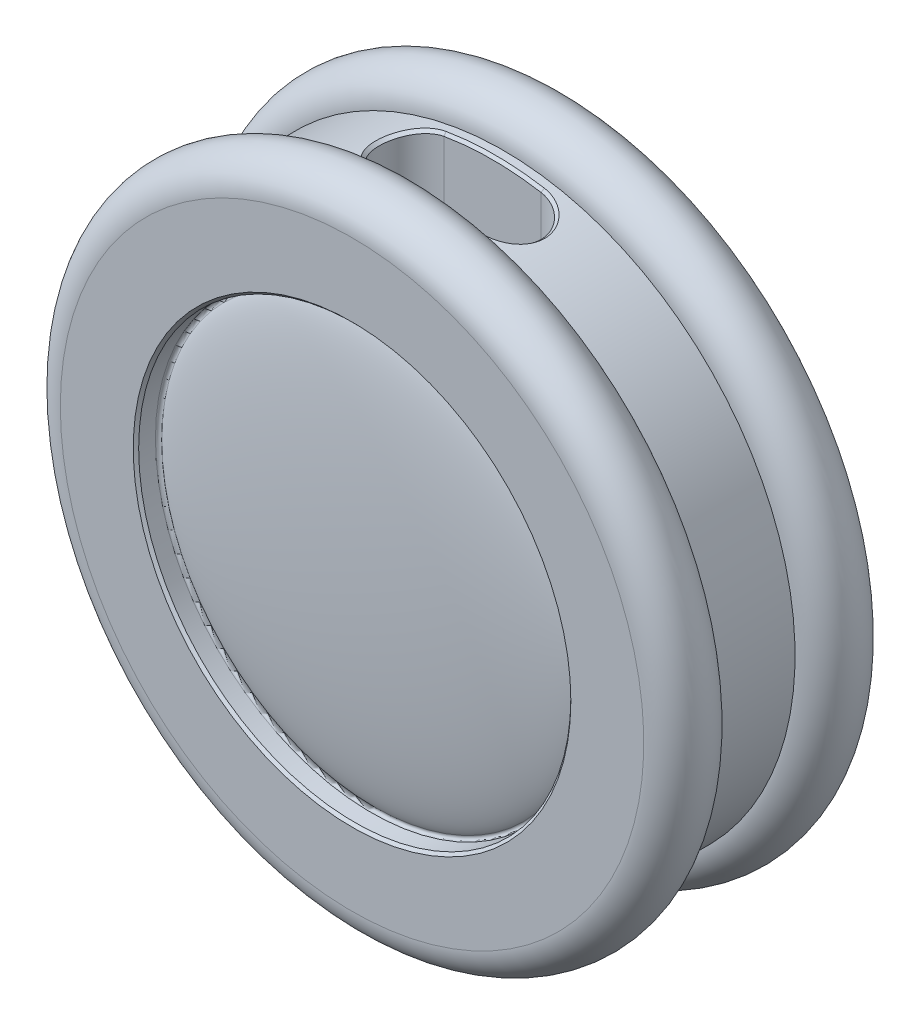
ISO-10303-21;
HEADER;
FILE_DESCRIPTION(('STEP AP214'),'2;1');
FILE_NAME('part.step','',(''),(''),'','','');
FILE_SCHEMA(('AUTOMOTIVE_DESIGN { 1 0 10303 214 1 1 1 1 }'));
ENDSEC;
DATA;
#1=APPLICATION_CONTEXT('core data for automotive mechanical design processes');
#2=APPLICATION_PROTOCOL_DEFINITION('international standard','automotive_design',2000,#1);
#3=PRODUCT_CONTEXT('',#1,'mechanical');
#4=PRODUCT('Part','Part','',(#3));
#5=PRODUCT_RELATED_PRODUCT_CATEGORY('part','',(#4));
#6=PRODUCT_DEFINITION_FORMATION('','',#4);
#7=PRODUCT_DEFINITION_CONTEXT('part definition',#1,'design');
#8=PRODUCT_DEFINITION('design','',#6,#7);
#9=PRODUCT_DEFINITION_SHAPE('','',#8);
#10=(LENGTH_UNIT() NAMED_UNIT(*) SI_UNIT(.MILLI.,.METRE.));
#11=(NAMED_UNIT(*) PLANE_ANGLE_UNIT() SI_UNIT($,.RADIAN.));
#12=(NAMED_UNIT(*) SI_UNIT($,.STERADIAN.) SOLID_ANGLE_UNIT());
#13=UNCERTAINTY_MEASURE_WITH_UNIT(LENGTH_MEASURE(1.E-05),#10,'distance_accuracy_value','');
#14=(GEOMETRIC_REPRESENTATION_CONTEXT(3) GLOBAL_UNCERTAINTY_ASSIGNED_CONTEXT((#13)) GLOBAL_UNIT_ASSIGNED_CONTEXT((#10,
#11,#12)) REPRESENTATION_CONTEXT('',''));
#15=CARTESIAN_POINT('',(0.,0.,0.));
#16=DIRECTION('',(0.,0.,1.));
#17=DIRECTION('',(1.,0.,0.));
#18=AXIS2_PLACEMENT_3D('',#15,#16,#17);
#19=CARTESIAN_POINT('',(0.,0.,-15.));
#20=DIRECTION('',(0.,1.,0.));
#21=DIRECTION('',(-1.,0.,0.));
#22=AXIS2_PLACEMENT_3D('',#19,#20,#21);
#23=ELLIPSE('',#22,40.,5.);
#24=TRIMMED_CURVE('',#23,(PARAMETER_VALUE(4.71238898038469)),
(PARAMETER_VALUE(7.85398163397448)),.T.,.PARAMETER.);
#25=CARTESIAN_POINT('',(0.,0.,-20.));
#26=DIRECTION('',(0.,0.,-1.));
#27=AXIS1_PLACEMENT('',#25,#26);
#28=SURFACE_OF_REVOLUTION('',#24,#27);
#29=CARTESIAN_POINT('',(0.,0.,-15.9740299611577));
#30=DIRECTION('',(0.,0.,-1.));
#31=DIRECTION('',(-1.,0.,0.));
#32=AXIS2_PLACEMENT_3D('',#29,#30,#31);
#33=CIRCLE('',#32,39.2336717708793);
#34=CARTESIAN_POINT('',(-39.2336717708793,0.,-15.9740299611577));
#35=VERTEX_POINT('',#34);
#36=EDGE_CURVE('E247',#35,#35,#33,.T.);
#37=ORIENTED_EDGE('',*,*,#36,.T.);
#38=EDGE_LOOP('',(#37));
#39=FACE_BOUND('',#38,.T.);
#40=CARTESIAN_POINT('',(0.,0.,-20.));
#41=VERTEX_POINT('',#40);
#42=VERTEX_LOOP('',#41);
#43=FACE_BOUND('',#42,.T.);
#44=ADVANCED_FACE('F31',(#39,#43),#28,.F.);
#45=CARTESIAN_POINT('',(0.,0.,-20.));
#46=DIRECTION('',(0.,0.,-1.));
#47=DIRECTION('',(-1.,0.,0.));
#48=AXIS2_PLACEMENT_3D('',#45,#46,#47);
#49=CYLINDRICAL_SURFACE('',#48,40.);
#50=CARTESIAN_POINT('',(0.,0.,-16.3971957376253));
#51=DIRECTION('',(0.,0.,-1.));
#52=DIRECTION('',(-1.,0.,0.));
#53=AXIS2_PLACEMENT_3D('',#50,#51,#52);
#54=CIRCLE('',#53,40.);
#55=CARTESIAN_POINT('',(-40.,0.,-16.3971957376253));
#56=VERTEX_POINT('',#55);
#57=EDGE_CURVE('E468',#56,#56,#54,.F.);
#58=ORIENTED_EDGE('',*,*,#57,.T.);
#59=EDGE_LOOP('',(#58));
#60=FACE_BOUND('',#59,.T.);
#61=CARTESIAN_POINT('',(0.,0.,-19.5));
#62=DIRECTION('',(0.,0.,-1.));
#63=DIRECTION('',(-1.,0.,0.));
#64=AXIS2_PLACEMENT_3D('',#61,#62,#63);
#65=CIRCLE('',#64,40.);
#66=CARTESIAN_POINT('',(-40.,0.,-19.5));
#67=VERTEX_POINT('',#66);
#68=EDGE_CURVE('E233',#67,#67,#65,.T.);
#69=ORIENTED_EDGE('',*,*,#68,.T.);
#70=EDGE_LOOP('',(#69));
#71=FACE_BOUND('',#70,.T.);
#72=ADVANCED_FACE('F120',(#60,#71),#49,.F.);
#73=CARTESIAN_POINT('',(-54.,0.,-20.));
#74=DIRECTION('',(0.,0.,-1.));
#75=DIRECTION('',(-1.,0.,0.));
#76=AXIS2_PLACEMENT_3D('',#73,#74,#75);
#77=PLANE('',#76);
#78=CARTESIAN_POINT('',(0.,0.,-20.));
#79=DIRECTION('',(0.,0.,-1.));
#80=DIRECTION('',(-1.,0.,0.));
#81=AXIS2_PLACEMENT_3D('',#78,#79,#80);
#82=CIRCLE('',#81,40.5);
#83=CARTESIAN_POINT('',(-40.5,0.,-20.));
#84=VERTEX_POINT('',#83);
#85=EDGE_CURVE('E238',#84,#84,#82,.F.);
#86=ORIENTED_EDGE('',*,*,#85,.T.);
#87=EDGE_LOOP('',(#86));
#88=FACE_BOUND('',#87,.T.);
#89=CARTESIAN_POINT('',(0.,0.,-20.));
#90=DIRECTION('',(0.,0.,-1.));
#91=DIRECTION('',(-1.,0.,0.));
#92=AXIS2_PLACEMENT_3D('',#89,#90,#91);
#93=CIRCLE('',#92,54.);
#94=CARTESIAN_POINT('',(-54.,0.,-20.));
#95=VERTEX_POINT('',#94);
#96=EDGE_CURVE('E153',#95,#95,#93,.T.);
#97=ORIENTED_EDGE('',*,*,#96,.T.);
#98=EDGE_LOOP('',(#97));
#99=FACE_BOUND('',#98,.T.);
#100=ADVANCED_FACE('F126',(#88,#99),#77,.T.);
#101=CARTESIAN_POINT('',(0.,0.,-14.));
#102=DIRECTION('',(0.,0.,-1.));
#103=DIRECTION('',(-1.,0.,0.));
#104=AXIS2_PLACEMENT_3D('',#101,#102,#103);
#105=TOROIDAL_SURFACE('',#104,54.,6.);
#106=CARTESIAN_POINT('',(0.,0.,-8.));
#107=DIRECTION('',(0.,0.,-1.));
#108=DIRECTION('',(-1.,0.,0.));
#109=AXIS2_PLACEMENT_3D('',#106,#107,#108);
#110=CIRCLE('',#109,54.);
#111=CARTESIAN_POINT('',(-54.,0.,-8.));
#112=VERTEX_POINT('',#111);
#113=EDGE_CURVE('E150',#112,#112,#110,.T.);
#114=ORIENTED_EDGE('',*,*,#113,.T.);
#115=EDGE_LOOP('',(#114));
#116=FACE_BOUND('',#115,.T.);
#117=ORIENTED_EDGE('',*,*,#96,.F.);
#118=EDGE_LOOP('',(#117));
#119=FACE_BOUND('',#118,.T.);
#120=ADVANCED_FACE('F502',(#116,#119),#105,.T.);
#121=CARTESIAN_POINT('',(0.,0.,-20.));
#122=DIRECTION('',(0.,0.,-1.));
#123=DIRECTION('',(-1.,0.,0.));
#124=AXIS2_PLACEMENT_3D('',#121,#122,#123);
#125=CYLINDRICAL_SURFACE('',#124,54.);
#126=CARTESIAN_POINT('',(9.08411214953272,53.2304321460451,6.50000000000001));
#127=CARTESIAN_POINT('',(10.8154472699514,52.9375034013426,6.50339188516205));
#128=CARTESIAN_POINT('',(12.4870608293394,52.5532988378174,5.80759504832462));
#129=CARTESIAN_POINT('',(14.9235216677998,51.9103789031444,3.4202630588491));
#130=CARTESIAN_POINT('',(15.6458849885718,51.6836683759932,1.72041286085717));
#131=CARTESIAN_POINT('',(15.6438259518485,51.6843827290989,-1.73537074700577));
#132=CARTESIAN_POINT('',(14.9175348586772,51.9119249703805,-3.42758029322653));
#133=CARTESIAN_POINT('',(12.4853224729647,52.5537794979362,-5.8078662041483));
#134=CARTESIAN_POINT('',(10.8023158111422,52.9398504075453,-6.503933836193));
#135=CARTESIAN_POINT('',(9.08411214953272,53.2304321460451,-6.5));
#136=B_SPLINE_CURVE_WITH_KNOTS('',3,(#126,#127,#128,#129,#130,#131,#132,#133,#134,#135),
.UNSPECIFIED.,.F.,.F.,(4,2,2,2,4),(0.,0.00514342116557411,0.0102868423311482,0.0154302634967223,
0.0205736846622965),.UNSPECIFIED.);
#137=CARTESIAN_POINT('',(9.08411214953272,53.2304321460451,-6.5));
#138=VERTEX_POINT('',#137);
#139=CARTESIAN_POINT('',(9.08411214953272,53.2304321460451,6.50000000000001));
#140=VERTEX_POINT('',#139);
#141=EDGE_CURVE('E558',#138,#140,#136,.F.);
#142=ORIENTED_EDGE('',*,*,#141,.T.);
#143=CARTESIAN_POINT('',(0.,0.,6.5));
#144=DIRECTION('',(0.,0.,1.));
#145=DIRECTION('',(1.,0.,0.));
#146=AXIS2_PLACEMENT_3D('',#143,#144,#145);
#147=CIRCLE('',#146,54.);
#148=CARTESIAN_POINT('',(-9.08411214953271,53.2304321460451,6.50000000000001));
#149=VERTEX_POINT('',#148);
#150=EDGE_CURVE('E560',#140,#149,#147,.T.);
#151=ORIENTED_EDGE('',*,*,#150,.T.);
#152=CARTESIAN_POINT('',(-9.0841121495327,53.2304321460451,-6.5));
#153=CARTESIAN_POINT('',(-10.8154472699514,52.9375034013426,-6.50339188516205));
#154=CARTESIAN_POINT('',(-12.4870608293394,52.5532988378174,-5.80759504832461));
#155=CARTESIAN_POINT('',(-14.9235216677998,51.9103789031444,-3.4202630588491));
#156=CARTESIAN_POINT('',(-15.6458849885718,51.6836683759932,-1.72041286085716));
#157=CARTESIAN_POINT('',(-15.6438259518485,51.6843827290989,1.73537074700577));
#158=CARTESIAN_POINT('',(-14.9175348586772,51.9119249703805,3.42758029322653));
#159=CARTESIAN_POINT('',(-12.4853224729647,52.5537794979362,5.80786620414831));
#160=CARTESIAN_POINT('',(-10.8023158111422,52.9398504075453,6.503933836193));
#161=CARTESIAN_POINT('',(-9.08411214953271,53.2304321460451,6.50000000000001));
#162=B_SPLINE_CURVE_WITH_KNOTS('',3,(#152,#153,#154,#155,#156,#157,#158,#159,#160,#161),
.UNSPECIFIED.,.F.,.F.,(4,2,2,2,4),(0.,0.00514342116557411,0.0102868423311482,0.0154302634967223,
0.0205736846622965),.UNSPECIFIED.);
#163=CARTESIAN_POINT('',(-9.0841121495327,53.2304321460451,-6.5));
#164=VERTEX_POINT('',#163);
#165=EDGE_CURVE('E348',#149,#164,#162,.F.);
#166=ORIENTED_EDGE('',*,*,#165,.T.);
#167=CARTESIAN_POINT('',(0.,0.,-6.5));
#168=DIRECTION('',(0.,0.,-1.));
#169=DIRECTION('',(-1.,0.,0.));
#170=AXIS2_PLACEMENT_3D('',#167,#168,#169);
#171=CIRCLE('',#170,54.);
#172=EDGE_CURVE('E544',#164,#138,#171,.T.);
#173=ORIENTED_EDGE('',*,*,#172,.T.);
#174=EDGE_LOOP('',(#142,#151,#166,#173));
#175=FACE_BOUND('',#174,.T.);
#176=CARTESIAN_POINT('',(-9.08411214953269,-53.2304321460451,6.50000000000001));
#177=CARTESIAN_POINT('',(-10.8154472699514,-52.9375034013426,6.50339188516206));
#178=CARTESIAN_POINT('',(-12.4870608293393,-52.5532988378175,5.80759504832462));
#179=CARTESIAN_POINT('',(-14.9235216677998,-51.9103789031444,3.42026305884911));
#180=CARTESIAN_POINT('',(-15.6458849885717,-51.6836683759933,1.72041286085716));
#181=CARTESIAN_POINT('',(-15.6438259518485,-51.6843827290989,-1.73537074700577));
#182=CARTESIAN_POINT('',(-14.9175348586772,-51.9119249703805,-3.42758029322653));
#183=CARTESIAN_POINT('',(-12.4853224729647,-52.5537794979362,-5.8078662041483));
#184=CARTESIAN_POINT('',(-10.8023158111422,-52.9398504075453,-6.50393383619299));
#185=CARTESIAN_POINT('',(-9.08411214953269,-53.2304321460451,-6.5));
#186=B_SPLINE_CURVE_WITH_KNOTS('',3,(#176,#177,#178,#179,#180,#181,#182,#183,#184,#185),
.UNSPECIFIED.,.F.,.F.,(4,2,2,2,4),(0.,0.00514342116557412,0.0102868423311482,0.0154302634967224,
0.0205736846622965),.UNSPECIFIED.);
#187=CARTESIAN_POINT('',(-9.08411214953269,-53.2304321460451,-6.5));
#188=VERTEX_POINT('',#187);
#189=CARTESIAN_POINT('',(-9.08411214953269,-53.2304321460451,6.50000000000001));
#190=VERTEX_POINT('',#189);
#191=EDGE_CURVE('E545',#188,#190,#186,.F.);
#192=ORIENTED_EDGE('',*,*,#191,.T.);
#193=CARTESIAN_POINT('',(0.,0.,6.5));
#194=DIRECTION('',(0.,0.,1.));
#195=DIRECTION('',(1.,0.,0.));
#196=AXIS2_PLACEMENT_3D('',#193,#194,#195);
#197=CIRCLE('',#196,54.);
#198=CARTESIAN_POINT('',(9.08411214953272,-53.2304321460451,6.5));
#199=VERTEX_POINT('',#198);
#200=EDGE_CURVE('E537',#190,#199,#197,.T.);
#201=ORIENTED_EDGE('',*,*,#200,.T.);
#202=CARTESIAN_POINT('',(9.08411214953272,-53.2304321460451,-6.50000000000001));
#203=CARTESIAN_POINT('',(10.8154472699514,-52.9375034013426,-6.50339188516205));
#204=CARTESIAN_POINT('',(12.4870608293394,-52.5532988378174,-5.80759504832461));
#205=CARTESIAN_POINT('',(14.9235216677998,-51.9103789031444,-3.4202630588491));
#206=CARTESIAN_POINT('',(15.6458849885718,-51.6836683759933,-1.72041286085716));
#207=CARTESIAN_POINT('',(15.6438259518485,-51.6843827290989,1.73537074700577));
#208=CARTESIAN_POINT('',(14.9175348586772,-51.9119249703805,3.42758029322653));
#209=CARTESIAN_POINT('',(12.4853224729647,-52.5537794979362,5.8078662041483));
#210=CARTESIAN_POINT('',(10.8023158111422,-52.9398504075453,6.50393383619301));
#211=CARTESIAN_POINT('',(9.08411214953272,-53.2304321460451,6.5));
#212=B_SPLINE_CURVE_WITH_KNOTS('',3,(#202,#203,#204,#205,#206,#207,#208,#209,#210,#211),
.UNSPECIFIED.,.F.,.F.,(4,2,2,2,4),(0.,0.00514342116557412,0.0102868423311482,0.0154302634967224,
0.0205736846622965),.UNSPECIFIED.);
#213=CARTESIAN_POINT('',(9.08411214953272,-53.2304321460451,-6.5));
#214=VERTEX_POINT('',#213);
#215=EDGE_CURVE('E457',#199,#214,#212,.F.);
#216=ORIENTED_EDGE('',*,*,#215,.T.);
#217=CARTESIAN_POINT('',(0.,0.,-6.5));
#218=DIRECTION('',(0.,0.,-1.));
#219=DIRECTION('',(-1.,0.,0.));
#220=AXIS2_PLACEMENT_3D('',#217,#218,#219);
#221=CIRCLE('',#220,54.);
#222=EDGE_CURVE('E571',#214,#188,#221,.T.);
#223=ORIENTED_EDGE('',*,*,#222,.T.);
#224=EDGE_LOOP('',(#192,#201,#216,#223));
#225=FACE_BOUND('',#224,.T.);
#226=CARTESIAN_POINT('',(0.,0.,8.));
#227=DIRECTION('',(0.,0.,-1.));
#228=DIRECTION('',(-1.,0.,0.));
#229=AXIS2_PLACEMENT_3D('',#226,#227,#228);
#230=CIRCLE('',#229,54.);
#231=CARTESIAN_POINT('',(-54.,0.,8.));
#232=VERTEX_POINT('',#231);
#233=EDGE_CURVE('E146',#232,#232,#230,.T.);
#234=ORIENTED_EDGE('',*,*,#233,.T.);
#235=EDGE_LOOP('',(#234));
#236=FACE_BOUND('',#235,.T.);
#237=ORIENTED_EDGE('',*,*,#113,.F.);
#238=EDGE_LOOP('',(#237));
#239=FACE_BOUND('',#238,.T.);
#240=ADVANCED_FACE('F506',(#175,#225,#236,#239),#125,.T.);
#241=CARTESIAN_POINT('',(0.,0.,14.));
#242=DIRECTION('',(0.,0.,-1.));
#243=DIRECTION('',(-1.,0.,0.));
#244=AXIS2_PLACEMENT_3D('',#241,#242,#243);
#245=TOROIDAL_SURFACE('',#244,54.,6.);
#246=CARTESIAN_POINT('',(0.,0.,20.));
#247=DIRECTION('',(0.,0.,-1.));
#248=DIRECTION('',(-1.,0.,0.));
#249=AXIS2_PLACEMENT_3D('',#246,#247,#248);
#250=CIRCLE('',#249,54.);
#251=CARTESIAN_POINT('',(-54.,0.,20.));
#252=VERTEX_POINT('',#251);
#253=EDGE_CURVE('E143',#252,#252,#250,.T.);
#254=ORIENTED_EDGE('',*,*,#253,.T.);
#255=EDGE_LOOP('',(#254));
#256=FACE_BOUND('',#255,.T.);
#257=ORIENTED_EDGE('',*,*,#233,.F.);
#258=EDGE_LOOP('',(#257));
#259=FACE_BOUND('',#258,.T.);
#260=ADVANCED_FACE('F512',(#256,#259),#245,.T.);
#261=CARTESIAN_POINT('',(-54.,0.,20.));
#262=DIRECTION('',(0.,0.,1.));
#263=DIRECTION('',(1.,0.,0.));
#264=AXIS2_PLACEMENT_3D('',#261,#262,#263);
#265=PLANE('',#264);
#266=CARTESIAN_POINT('',(0.,0.,20.));
#267=DIRECTION('',(0.,0.,1.));
#268=DIRECTION('',(1.,0.,0.));
#269=AXIS2_PLACEMENT_3D('',#266,#267,#268);
#270=CIRCLE('',#269,40.5);
#271=CARTESIAN_POINT('',(40.5,0.,20.));
#272=VERTEX_POINT('',#271);
#273=EDGE_CURVE('E241',#272,#272,#270,.F.);
#274=ORIENTED_EDGE('',*,*,#273,.T.);
#275=EDGE_LOOP('',(#274));
#276=FACE_BOUND('',#275,.T.);
#277=ORIENTED_EDGE('',*,*,#253,.F.);
#278=EDGE_LOOP('',(#277));
#279=FACE_BOUND('',#278,.T.);
#280=ADVANCED_FACE('F115',(#276,#279),#265,.T.);
#281=CARTESIAN_POINT('',(0.,0.,-20.));
#282=DIRECTION('',(0.,0.,-1.));
#283=DIRECTION('',(-1.,0.,0.));
#284=AXIS2_PLACEMENT_3D('',#281,#282,#283);
#285=CYLINDRICAL_SURFACE('',#284,40.);
#286=CARTESIAN_POINT('',(0.,0.,16.3971957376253));
#287=DIRECTION('',(0.,0.,-1.));
#288=DIRECTION('',(-1.,0.,0.));
#289=AXIS2_PLACEMENT_3D('',#286,#287,#288);
#290=CIRCLE('',#289,40.);
#291=CARTESIAN_POINT('',(-40.,0.,16.3971957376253));
#292=VERTEX_POINT('',#291);
#293=EDGE_CURVE('E39',#292,#292,#290,.T.);
#294=ORIENTED_EDGE('',*,*,#293,.T.);
#295=EDGE_LOOP('',(#294));
#296=FACE_BOUND('',#295,.T.);
#297=CARTESIAN_POINT('',(0.,0.,19.5));
#298=DIRECTION('',(0.,0.,1.));
#299=DIRECTION('',(1.,0.,0.));
#300=AXIS2_PLACEMENT_3D('',#297,#298,#299);
#301=CIRCLE('',#300,40.);
#302=CARTESIAN_POINT('',(40.,0.,19.5));
#303=VERTEX_POINT('',#302);
#304=EDGE_CURVE('E244',#303,#303,#301,.T.);
#305=ORIENTED_EDGE('',*,*,#304,.T.);
#306=EDGE_LOOP('',(#305));
#307=FACE_BOUND('',#306,.T.);
#308=ADVANCED_FACE('F106',(#296,#307),#285,.F.);
#309=CARTESIAN_POINT('',(0.,0.,15.));
#310=DIRECTION('',(0.,1.,0.));
#311=DIRECTION('',(1.,0.,0.));
#312=AXIS2_PLACEMENT_3D('',#309,#310,#311);
#313=ELLIPSE('',#312,40.,5.);
#314=TRIMMED_CURVE('',#313,(PARAMETER_VALUE(1.5707963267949)),
(PARAMETER_VALUE(4.71238898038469)),.T.,.PARAMETER.);
#315=CARTESIAN_POINT('',(0.,0.,-20.));
#316=DIRECTION('',(0.,0.,-1.));
#317=AXIS1_PLACEMENT('',#315,#316);
#318=SURFACE_OF_REVOLUTION('',#314,#317);
#319=CARTESIAN_POINT('',(0.,0.,15.9740299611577));
#320=DIRECTION('',(0.,0.,-1.));
#321=DIRECTION('',(-1.,0.,0.));
#322=AXIS2_PLACEMENT_3D('',#319,#320,#321);
#323=CIRCLE('',#322,39.2336717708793);
#324=CARTESIAN_POINT('',(-39.2336717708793,0.,15.9740299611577));
#325=VERTEX_POINT('',#324);
#326=EDGE_CURVE('E11',#325,#325,#323,.F.);
#327=ORIENTED_EDGE('',*,*,#326,.T.);
#328=EDGE_LOOP('',(#327));
#329=FACE_BOUND('',#328,.T.);
#330=CARTESIAN_POINT('',(0.,0.,20.));
#331=VERTEX_POINT('',#330);
#332=VERTEX_LOOP('',#331);
#333=FACE_BOUND('',#332,.T.);
#334=ADVANCED_FACE('F103',(#329,#333),#318,.F.);
#335=CARTESIAN_POINT('',(-9.,-55.,0.));
#336=DIRECTION('',(0.,1.,0.));
#337=DIRECTION('',(0.,0.,1.));
#338=AXIS2_PLACEMENT_3D('',#335,#336,#337);
#339=CYLINDRICAL_SURFACE('',#338,6.);
#340=DIRECTION('',(0.,1.,0.));
#341=VECTOR('',#340,1.);
#342=CARTESIAN_POINT('',(-9.,-55.,-5.99999999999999));
#343=LINE('',#342,#341);
#344=CARTESIAN_POINT('',(-9.,-52.7375577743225,-5.99999999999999));
#345=VERTEX_POINT('',#344);
#346=CARTESIAN_POINT('',(-9.,52.7375577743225,-5.99999999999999));
#347=VERTEX_POINT('',#346);
#348=EDGE_CURVE('E147',#345,#347,#343,.T.);
#349=ORIENTED_EDGE('',*,*,#348,.T.);
#350=CARTESIAN_POINT('',(-9.00000000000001,52.7375577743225,6.00000000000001));
#351=CARTESIAN_POINT('',(-10.5713486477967,52.4496666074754,6.00363123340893));
#352=CARTESIAN_POINT('',(-12.1105086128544,52.067170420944,5.36110723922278));
#353=CARTESIAN_POINT('',(-14.3348395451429,51.4312590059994,3.16392029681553));
#354=CARTESIAN_POINT('',(-14.9990545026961,51.2058236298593,1.60188115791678));
#355=CARTESIAN_POINT('',(-15.0009375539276,51.2051158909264,-1.58807387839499));
#356=CARTESIAN_POINT('',(-14.3403146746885,51.4297272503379,-3.1571659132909));
#357=CARTESIAN_POINT('',(-12.1120983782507,52.0666942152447,-5.36085695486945));
#358=CARTESIAN_POINT('',(-10.5833577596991,52.4473413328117,-6.00313097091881));
#359=CARTESIAN_POINT('',(-9.,52.7375577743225,-6.));
#360=B_SPLINE_CURVE_WITH_KNOTS('',3,(#350,#351,#352,#353,#354,#355,#356,#357,#358,#359),
.UNSPECIFIED.,.F.,.F.,(4,2,2,2,4),(0.,0.00514342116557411,0.0102868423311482,0.0154302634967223,
0.0205736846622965),.UNSPECIFIED.);
#361=CARTESIAN_POINT('',(-9.,52.7375577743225,6.00000000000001));
#362=VERTEX_POINT('',#361);
#363=EDGE_CURVE('E229',#347,#362,#360,.F.);
#364=ORIENTED_EDGE('',*,*,#363,.T.);
#365=DIRECTION('',(0.,1.,0.));
#366=VECTOR('',#365,1.);
#367=CARTESIAN_POINT('',(-9.,-55.,6.00000000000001));
#368=LINE('',#367,#366);
#369=CARTESIAN_POINT('',(-9.,-52.7375577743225,6.00000000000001));
#370=VERTEX_POINT('',#369);
#371=EDGE_CURVE('E157',#370,#362,#368,.T.);
#372=ORIENTED_EDGE('',*,*,#371,.F.);
#373=CARTESIAN_POINT('',(-9.,-52.7375577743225,-5.99999999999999));
#374=CARTESIAN_POINT('',(-10.5713486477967,-52.4496666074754,-6.00363123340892));
#375=CARTESIAN_POINT('',(-12.1105086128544,-52.067170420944,-5.36110723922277));
#376=CARTESIAN_POINT('',(-14.3348395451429,-51.4312590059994,-3.16392029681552));
#377=CARTESIAN_POINT('',(-14.9990545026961,-51.2058236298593,-1.60188115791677));
#378=CARTESIAN_POINT('',(-15.0009375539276,-51.2051158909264,1.58807387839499));
#379=CARTESIAN_POINT('',(-14.3403146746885,-51.4297272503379,3.1571659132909));
#380=CARTESIAN_POINT('',(-12.1120983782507,-52.0666942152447,5.36085695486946));
#381=CARTESIAN_POINT('',(-10.5833577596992,-52.4473413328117,6.00313097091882));
#382=CARTESIAN_POINT('',(-9.,-52.7375577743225,6.00000000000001));
#383=B_SPLINE_CURVE_WITH_KNOTS('',3,(#373,#374,#375,#376,#377,#378,#379,#380,#381,#382),
.UNSPECIFIED.,.F.,.F.,(4,2,2,2,4),(0.,0.00514342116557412,0.0102868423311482,0.0154302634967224,
0.0205736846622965),.UNSPECIFIED.);
#384=EDGE_CURVE('E53',#370,#345,#383,.F.);
#385=ORIENTED_EDGE('',*,*,#384,.T.);
#386=EDGE_LOOP('',(#349,#364,#372,#385));
#387=FACE_BOUND('',#386,.T.);
#388=ADVANCED_FACE('F105',(#387),#339,.F.);
#389=CARTESIAN_POINT('',(9.,-55.,-6.));
#390=DIRECTION('',(0.,0.,-1.));
#391=DIRECTION('',(-1.,0.,0.));
#392=AXIS2_PLACEMENT_3D('',#389,#390,#391);
#393=PLANE('',#392);
#394=DIRECTION('',(0.,1.,0.));
#395=VECTOR('',#394,1.);
#396=CARTESIAN_POINT('',(9.,-55.,-6.));
#397=LINE('',#396,#395);
#398=CARTESIAN_POINT('',(9.,-52.7375577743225,-6.));
#399=VERTEX_POINT('',#398);
#400=CARTESIAN_POINT('',(9.,52.7375577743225,-6.));
#401=VERTEX_POINT('',#400);
#402=EDGE_CURVE('E164',#399,#401,#397,.T.);
#403=ORIENTED_EDGE('',*,*,#402,.T.);
#404=CARTESIAN_POINT('',(0.,0.,-6.));
#405=DIRECTION('',(0.,0.,-1.));
#406=DIRECTION('',(-1.,0.,0.));
#407=AXIS2_PLACEMENT_3D('',#404,#405,#406);
#408=CIRCLE('',#407,53.5);
#409=EDGE_CURVE('E46',#401,#347,#408,.F.);
#410=ORIENTED_EDGE('',*,*,#409,.T.);
#411=ORIENTED_EDGE('',*,*,#348,.F.);
#412=CARTESIAN_POINT('',(0.,0.,-6.));
#413=DIRECTION('',(0.,0.,-1.));
#414=DIRECTION('',(-1.,0.,0.));
#415=AXIS2_PLACEMENT_3D('',#412,#413,#414);
#416=CIRCLE('',#415,53.5);
#417=EDGE_CURVE('E222',#345,#399,#416,.F.);
#418=ORIENTED_EDGE('',*,*,#417,.T.);
#419=EDGE_LOOP('',(#403,#410,#411,#418));
#420=FACE_BOUND('',#419,.T.);
#421=ADVANCED_FACE('F113',(#420),#393,.F.);
#422=CARTESIAN_POINT('',(9.,-55.,0.));
#423=DIRECTION('',(0.,1.,0.));
#424=DIRECTION('',(0.,0.,1.));
#425=AXIS2_PLACEMENT_3D('',#422,#423,#424);
#426=CYLINDRICAL_SURFACE('',#425,6.);
#427=DIRECTION('',(0.,1.,0.));
#428=VECTOR('',#427,1.);
#429=CARTESIAN_POINT('',(9.,-55.,6.));
#430=LINE('',#429,#428);
#431=CARTESIAN_POINT('',(9.,-52.7375577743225,6.));
#432=VERTEX_POINT('',#431);
#433=CARTESIAN_POINT('',(9.,52.7375577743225,6.));
#434=VERTEX_POINT('',#433);
#435=EDGE_CURVE('E160',#432,#434,#430,.T.);
#436=ORIENTED_EDGE('',*,*,#435,.T.);
#437=CARTESIAN_POINT('',(9.,52.7375577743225,-6.));
#438=CARTESIAN_POINT('',(10.5713486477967,52.4496666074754,-6.00363123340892));
#439=CARTESIAN_POINT('',(12.1105086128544,52.067170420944,-5.36110723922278));
#440=CARTESIAN_POINT('',(14.3348395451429,51.4312590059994,-3.16392029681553));
#441=CARTESIAN_POINT('',(14.9990545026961,51.2058236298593,-1.60188115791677));
#442=CARTESIAN_POINT('',(15.0009375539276,51.2051158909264,1.58807387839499));
#443=CARTESIAN_POINT('',(14.3403146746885,51.4297272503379,3.1571659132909));
#444=CARTESIAN_POINT('',(12.1120983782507,52.0666942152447,5.36085695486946));
#445=CARTESIAN_POINT('',(10.5833577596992,52.4473413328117,6.00313097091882));
#446=CARTESIAN_POINT('',(9.00000000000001,52.7375577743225,6.00000000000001));
#447=B_SPLINE_CURVE_WITH_KNOTS('',3,(#437,#438,#439,#440,#441,#442,#443,#444,#445,#446),
.UNSPECIFIED.,.F.,.F.,(4,2,2,2,4),(0.,0.00514342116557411,0.0102868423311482,0.0154302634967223,
0.0205736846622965),.UNSPECIFIED.);
#448=EDGE_CURVE('E562',#434,#401,#447,.F.);
#449=ORIENTED_EDGE('',*,*,#448,.T.);
#450=ORIENTED_EDGE('',*,*,#402,.F.);
#451=CARTESIAN_POINT('',(9.,-52.7375577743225,6.));
#452=CARTESIAN_POINT('',(10.5713486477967,-52.4496666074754,6.00363123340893));
#453=CARTESIAN_POINT('',(12.1105086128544,-52.067170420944,5.36110723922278));
#454=CARTESIAN_POINT('',(14.3348395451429,-51.4312590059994,3.16392029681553));
#455=CARTESIAN_POINT('',(14.9990545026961,-51.2058236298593,1.60188115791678));
#456=CARTESIAN_POINT('',(15.0009375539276,-51.2051158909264,-1.58807387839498));
#457=CARTESIAN_POINT('',(14.3403146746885,-51.4297272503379,-3.1571659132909));
#458=CARTESIAN_POINT('',(12.1120983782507,-52.0666942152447,-5.36085695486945));
#459=CARTESIAN_POINT('',(10.5833577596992,-52.4473413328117,-6.00313097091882));
#460=CARTESIAN_POINT('',(9.,-52.7375577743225,-6.));
#461=B_SPLINE_CURVE_WITH_KNOTS('',3,(#451,#452,#453,#454,#455,#456,#457,#458,#459,#460),
.UNSPECIFIED.,.F.,.F.,(4,2,2,2,4),(0.,0.00514342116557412,0.0102868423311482,0.0154302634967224,
0.0205736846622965),.UNSPECIFIED.);
#462=EDGE_CURVE('E180',#399,#432,#461,.F.);
#463=ORIENTED_EDGE('',*,*,#462,.T.);
#464=EDGE_LOOP('',(#436,#449,#450,#463));
#465=FACE_BOUND('',#464,.T.);
#466=ADVANCED_FACE('F187',(#465),#426,.F.);
#467=CARTESIAN_POINT('',(9.,-55.,6.));
#468=DIRECTION('',(0.,0.,1.));
#469=DIRECTION('',(1.,0.,0.));
#470=AXIS2_PLACEMENT_3D('',#467,#468,#469);
#471=PLANE('',#470);
#472=ORIENTED_EDGE('',*,*,#371,.T.);
#473=CARTESIAN_POINT('',(0.,0.,6.));
#474=DIRECTION('',(0.,0.,1.));
#475=DIRECTION('',(1.,0.,0.));
#476=AXIS2_PLACEMENT_3D('',#473,#474,#475);
#477=CIRCLE('',#476,53.5);
#478=EDGE_CURVE('E568',#362,#434,#477,.F.);
#479=ORIENTED_EDGE('',*,*,#478,.T.);
#480=ORIENTED_EDGE('',*,*,#435,.F.);
#481=CARTESIAN_POINT('',(0.,0.,6.));
#482=DIRECTION('',(0.,0.,1.));
#483=DIRECTION('',(1.,0.,0.));
#484=AXIS2_PLACEMENT_3D('',#481,#482,#483);
#485=CIRCLE('',#484,53.5);
#486=EDGE_CURVE('E156',#432,#370,#485,.F.);
#487=ORIENTED_EDGE('',*,*,#486,.T.);
#488=EDGE_LOOP('',(#472,#479,#480,#487));
#489=FACE_BOUND('',#488,.T.);
#490=ADVANCED_FACE('F197',(#489),#471,.F.);
#491=CARTESIAN_POINT('',(0.,0.,-6.));
#492=DIRECTION('',(0.,0.,-1.));
#493=DIRECTION('',(-1.,0.,0.));
#494=AXIS2_PLACEMENT_3D('',#491,#492,#493);
#495=CONICAL_SURFACE('',#494,53.5,0.785398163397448);
#496=CARTESIAN_POINT('',(9.08411214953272,53.2304321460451,-6.5));
#497=CARTESIAN_POINT('',(9.,52.7375577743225,-6.));
#498=B_SPLINE_CURVE_WITH_KNOTS('',1,(#496,#497),.UNSPECIFIED.,.F.,.F.,(2,2),(0.,1.),.UNSPECIFIED.);
#499=EDGE_CURVE('E314',#138,#401,#498,.T.);
#500=ORIENTED_EDGE('',*,*,#499,.F.);
#501=ORIENTED_EDGE('',*,*,#172,.F.);
#502=CARTESIAN_POINT('',(-9.,52.7375577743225,-6.));
#503=CARTESIAN_POINT('',(-9.00350467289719,52.7580942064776,-6.02083333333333));
#504=CARTESIAN_POINT('',(-9.00700934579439,52.7786306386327,-6.04166666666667));
#505=CARTESIAN_POINT('',(-9.01401869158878,52.8197035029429,-6.08333333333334));
#506=CARTESIAN_POINT('',(-9.01752336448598,52.840239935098,-6.10416666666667));
#507=CARTESIAN_POINT('',(-9.02453271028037,52.8813127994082,-6.14583333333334));
#508=CARTESIAN_POINT('',(-9.02803738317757,52.9018492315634,-6.16666666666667));
#509=CARTESIAN_POINT('',(-9.03504672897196,52.9429220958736,-6.20833333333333));
#510=CARTESIAN_POINT('',(-9.03855140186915,52.9634585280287,-6.22916666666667));
#511=CARTESIAN_POINT('',(-9.04556074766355,53.0045313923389,-6.27083333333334));
#512=CARTESIAN_POINT('',(-9.04906542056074,53.025067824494,-6.29166666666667));
#513=CARTESIAN_POINT('',(-9.05607476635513,53.0661406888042,-6.33333333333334));
#514=CARTESIAN_POINT('',(-9.05957943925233,53.0866771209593,-6.35416666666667));
#515=CARTESIAN_POINT('',(-9.06658878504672,53.1277499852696,-6.39583333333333));
#516=CARTESIAN_POINT('',(-9.07009345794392,53.1482864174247,-6.41666666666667));
#517=CARTESIAN_POINT('',(-9.07710280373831,53.1893592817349,-6.45833333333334));
#518=CARTESIAN_POINT('',(-9.08060747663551,53.20989571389,-6.47916666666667));
#519=CARTESIAN_POINT('',(-9.0841121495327,53.2304321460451,-6.5));
#520=B_SPLINE_CURVE_WITH_KNOTS('',3,(#502,#503,#504,#505,#506,#507,#508,#509,#510,#511,#512,
#513,#514,#515,#516,#517,#518,#519),.UNSPECIFIED.,.F.,.F.,(4,2,2,2,2,2,2,2,4),(0.,
0.0883883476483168,0.176776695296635,0.265165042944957,0.353553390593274,0.441941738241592,
0.530330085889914,0.618718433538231,0.707106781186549),.UNSPECIFIED.);
#521=EDGE_CURVE('E161',#347,#164,#520,.T.);
#522=ORIENTED_EDGE('',*,*,#521,.F.);
#523=ORIENTED_EDGE('',*,*,#409,.F.);
#524=EDGE_LOOP('',(#500,#501,#522,#523));
#525=FACE_BOUND('',#524,.T.);
#526=ADVANCED_FACE('F318',(#525),#495,.T.);
#527=CARTESIAN_POINT('',(-9.,52.7375577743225,-6.));
#528=CARTESIAN_POINT('',(-10.5833577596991,52.4473413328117,-6.00313097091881));
#529=CARTESIAN_POINT('',(-12.1120983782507,52.0666942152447,-5.36085695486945));
#530=CARTESIAN_POINT('',(-14.3403146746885,51.4297272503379,-3.1571659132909));
#531=CARTESIAN_POINT('',(-15.0009375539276,51.2051158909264,-1.58807387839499));
#532=CARTESIAN_POINT('',(-14.9990545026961,51.2058236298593,1.60188115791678));
#533=CARTESIAN_POINT('',(-14.3348395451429,51.4312590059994,3.16392029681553));
#534=CARTESIAN_POINT('',(-12.1105086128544,52.067170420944,5.36110723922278));
#535=CARTESIAN_POINT('',(-10.5713486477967,52.4496666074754,6.00363123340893));
#536=CARTESIAN_POINT('',(-9.00000000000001,52.7375577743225,6.00000000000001));
#537=CARTESIAN_POINT('',(-9.0841121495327,53.2304321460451,-6.5));
#538=CARTESIAN_POINT('',(-10.8154472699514,52.9375034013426,-6.50339188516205));
#539=CARTESIAN_POINT('',(-12.4870608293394,52.5532988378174,-5.80759504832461));
#540=CARTESIAN_POINT('',(-14.9235216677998,51.9103789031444,-3.4202630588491));
#541=CARTESIAN_POINT('',(-15.6458849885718,51.6836683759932,-1.72041286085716));
#542=CARTESIAN_POINT('',(-15.6438259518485,51.6843827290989,1.73537074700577));
#543=CARTESIAN_POINT('',(-14.9175348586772,51.9119249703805,3.42758029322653));
#544=CARTESIAN_POINT('',(-12.4853224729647,52.5537794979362,5.80786620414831));
#545=CARTESIAN_POINT('',(-10.8023158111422,52.9398504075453,6.503933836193));
#546=CARTESIAN_POINT('',(-9.08411214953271,53.2304321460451,6.50000000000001));
#547=B_SPLINE_SURFACE_WITH_KNOTS('',1,3,((#527,#528,#529,#530,#531,#532,#533,#534,#535,#536),
(#537,#538,#539,#540,#541,#542,#543,#544,#545,#546)),.UNSPECIFIED.,.F.,.F.,.F.,(2,2),(4,2,2,2,
4),(0.,1.),(0.,0.00514342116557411,0.0102868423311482,0.0154302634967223,0.0205736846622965),.UNSPECIFIED.);
#548=CARTESIAN_POINT('',(-9.08411214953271,53.2304321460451,6.50000000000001));
#549=CARTESIAN_POINT('',(-9.00000000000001,52.7375577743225,6.00000000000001));
#550=B_SPLINE_CURVE_WITH_KNOTS('',1,(#548,#549),.UNSPECIFIED.,.F.,.F.,(2,2),(0.,1.),.UNSPECIFIED.);
#551=EDGE_CURVE('E561',#362,#149,#550,.F.);
#552=ORIENTED_EDGE('',*,*,#521,.T.);
#553=ORIENTED_EDGE('',*,*,#165,.F.);
#554=ORIENTED_EDGE('',*,*,#551,.F.);
#555=ORIENTED_EDGE('',*,*,#363,.F.);
#556=EDGE_LOOP('',(#552,#553,#554,#555));
#557=FACE_BOUND('',#556,.T.);
#558=ADVANCED_FACE('F281',(#557),#547,.T.);
#559=CARTESIAN_POINT('',(9.00000000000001,52.7375577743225,6.00000000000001));
#560=CARTESIAN_POINT('',(10.5833577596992,52.4473413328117,6.00313097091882));
#561=CARTESIAN_POINT('',(12.1120983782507,52.0666942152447,5.36085695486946));
#562=CARTESIAN_POINT('',(14.3403146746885,51.4297272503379,3.1571659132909));
#563=CARTESIAN_POINT('',(15.0009375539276,51.2051158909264,1.58807387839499));
#564=CARTESIAN_POINT('',(14.9990545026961,51.2058236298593,-1.60188115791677));
#565=CARTESIAN_POINT('',(14.3348395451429,51.4312590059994,-3.16392029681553));
#566=CARTESIAN_POINT('',(12.1105086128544,52.067170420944,-5.36110723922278));
#567=CARTESIAN_POINT('',(10.5713486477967,52.4496666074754,-6.00363123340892));
#568=CARTESIAN_POINT('',(9.,52.7375577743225,-6.));
#569=CARTESIAN_POINT('',(9.08411214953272,53.2304321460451,6.50000000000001));
#570=CARTESIAN_POINT('',(10.8154472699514,52.9375034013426,6.50339188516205));
#571=CARTESIAN_POINT('',(12.4870608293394,52.5532988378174,5.80759504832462));
#572=CARTESIAN_POINT('',(14.9235216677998,51.9103789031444,3.4202630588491));
#573=CARTESIAN_POINT('',(15.6458849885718,51.6836683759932,1.72041286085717));
#574=CARTESIAN_POINT('',(15.6438259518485,51.6843827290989,-1.73537074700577));
#575=CARTESIAN_POINT('',(14.9175348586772,51.9119249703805,-3.42758029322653));
#576=CARTESIAN_POINT('',(12.4853224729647,52.5537794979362,-5.8078662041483));
#577=CARTESIAN_POINT('',(10.8023158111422,52.9398504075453,-6.503933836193));
#578=CARTESIAN_POINT('',(9.08411214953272,53.2304321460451,-6.5));
#579=B_SPLINE_SURFACE_WITH_KNOTS('',1,3,((#559,#560,#561,#562,#563,#564,#565,#566,#567,#568),
(#569,#570,#571,#572,#573,#574,#575,#576,#577,#578)),.UNSPECIFIED.,.F.,.F.,.F.,(2,2),(4,2,2,2,
4),(0.,1.),(0.,0.00514342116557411,0.0102868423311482,0.0154302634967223,0.0205736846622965),.UNSPECIFIED.);
#580=CARTESIAN_POINT('',(9.00000000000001,52.7375577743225,6.00000000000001));
#581=CARTESIAN_POINT('',(9.0035046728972,52.7580942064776,6.02083333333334));
#582=CARTESIAN_POINT('',(9.0070093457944,52.7786306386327,6.04166666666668));
#583=CARTESIAN_POINT('',(9.01401869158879,52.8197035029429,6.08333333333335));
#584=CARTESIAN_POINT('',(9.01752336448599,52.840239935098,6.10416666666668));
#585=CARTESIAN_POINT('',(9.02453271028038,52.8813127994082,6.14583333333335));
#586=CARTESIAN_POINT('',(9.02803738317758,52.9018492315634,6.16666666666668));
#587=CARTESIAN_POINT('',(9.03504672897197,52.9429220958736,6.20833333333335));
#588=CARTESIAN_POINT('',(9.03855140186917,52.9634585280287,6.22916666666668));
#589=CARTESIAN_POINT('',(9.04556074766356,53.0045313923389,6.27083333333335));
#590=CARTESIAN_POINT('',(9.04906542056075,53.025067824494,6.29166666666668));
#591=CARTESIAN_POINT('',(9.05607476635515,53.0661406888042,6.33333333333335));
#592=CARTESIAN_POINT('',(9.05957943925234,53.0866771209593,6.35416666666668));
#593=CARTESIAN_POINT('',(9.06658878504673,53.1277499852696,6.39583333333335));
#594=CARTESIAN_POINT('',(9.07009345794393,53.1482864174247,6.41666666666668));
#595=CARTESIAN_POINT('',(9.07710280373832,53.1893592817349,6.45833333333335));
#596=CARTESIAN_POINT('',(9.08060747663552,53.20989571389,6.47916666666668));
#597=CARTESIAN_POINT('',(9.08411214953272,53.2304321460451,6.50000000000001));
#598=B_SPLINE_CURVE_WITH_KNOTS('',3,(#580,#581,#582,#583,#584,#585,#586,#587,#588,#589,#590,
#591,#592,#593,#594,#595,#596,#597),.UNSPECIFIED.,.F.,.F.,(4,2,2,2,2,2,2,2,4),(0.,
0.0883883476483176,0.176776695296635,0.265165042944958,0.353553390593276,0.441941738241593,
0.530330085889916,0.618718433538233,0.707106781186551),.UNSPECIFIED.);
#599=EDGE_CURVE('E253',#140,#434,#598,.F.);
#600=ORIENTED_EDGE('',*,*,#499,.T.);
#601=ORIENTED_EDGE('',*,*,#448,.F.);
#602=ORIENTED_EDGE('',*,*,#599,.F.);
#603=ORIENTED_EDGE('',*,*,#141,.F.);
#604=EDGE_LOOP('',(#600,#601,#602,#603));
#605=FACE_BOUND('',#604,.T.);
#606=ADVANCED_FACE('F270',(#605),#579,.T.);
#607=CARTESIAN_POINT('',(0.,0.,6.));
#608=DIRECTION('',(0.,0.,1.));
#609=DIRECTION('',(1.,0.,0.));
#610=AXIS2_PLACEMENT_3D('',#607,#608,#609);
#611=CONICAL_SURFACE('',#610,53.5,0.785398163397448);
#612=ORIENTED_EDGE('',*,*,#551,.T.);
#613=ORIENTED_EDGE('',*,*,#150,.F.);
#614=ORIENTED_EDGE('',*,*,#599,.T.);
#615=ORIENTED_EDGE('',*,*,#478,.F.);
#616=EDGE_LOOP('',(#612,#613,#614,#615));
#617=FACE_BOUND('',#616,.T.);
#618=ADVANCED_FACE('F134',(#617),#611,.T.);
#619=CARTESIAN_POINT('',(0.,0.,-6.));
#620=DIRECTION('',(0.,0.,-1.));
#621=DIRECTION('',(-1.,0.,0.));
#622=AXIS2_PLACEMENT_3D('',#619,#620,#621);
#623=CONICAL_SURFACE('',#622,53.5,0.785398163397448);
#624=CARTESIAN_POINT('',(-9.08411214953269,-53.2304321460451,-6.5));
#625=CARTESIAN_POINT('',(-9.,-52.7375577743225,-5.99999999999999));
#626=B_SPLINE_CURVE_WITH_KNOTS('',1,(#624,#625),.UNSPECIFIED.,.F.,.F.,(2,2),(0.,1.),.UNSPECIFIED.);
#627=EDGE_CURVE('E424',#188,#345,#626,.T.);
#628=ORIENTED_EDGE('',*,*,#627,.F.);
#629=ORIENTED_EDGE('',*,*,#222,.F.);
#630=CARTESIAN_POINT('',(9.,-52.7375577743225,-6.));
#631=CARTESIAN_POINT('',(9.0035046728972,-52.7580942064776,-6.02083333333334));
#632=CARTESIAN_POINT('',(9.0070093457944,-52.7786306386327,-6.04166666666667));
#633=CARTESIAN_POINT('',(9.01401869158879,-52.8197035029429,-6.08333333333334));
#634=CARTESIAN_POINT('',(9.01752336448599,-52.840239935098,-6.10416666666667));
#635=CARTESIAN_POINT('',(9.02453271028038,-52.8813127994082,-6.14583333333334));
#636=CARTESIAN_POINT('',(9.02803738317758,-52.9018492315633,-6.16666666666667));
#637=CARTESIAN_POINT('',(9.03504672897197,-52.9429220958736,-6.20833333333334));
#638=CARTESIAN_POINT('',(9.03855140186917,-52.9634585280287,-6.22916666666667));
#639=CARTESIAN_POINT('',(9.04556074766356,-53.0045313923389,-6.27083333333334));
#640=CARTESIAN_POINT('',(9.04906542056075,-53.025067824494,-6.29166666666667));
#641=CARTESIAN_POINT('',(9.05607476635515,-53.0661406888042,-6.33333333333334));
#642=CARTESIAN_POINT('',(9.05957943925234,-53.0866771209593,-6.35416666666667));
#643=CARTESIAN_POINT('',(9.06658878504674,-53.1277499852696,-6.39583333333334));
#644=CARTESIAN_POINT('',(9.07009345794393,-53.1482864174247,-6.41666666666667));
#645=CARTESIAN_POINT('',(9.07710280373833,-53.1893592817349,-6.45833333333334));
#646=CARTESIAN_POINT('',(9.08060747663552,-53.20989571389,-6.47916666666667));
#647=CARTESIAN_POINT('',(9.08411214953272,-53.2304321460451,-6.50000000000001));
#648=B_SPLINE_CURVE_WITH_KNOTS('',3,(#630,#631,#632,#633,#634,#635,#636,#637,#638,#639,#640,
#641,#642,#643,#644,#645,#646,#647),.UNSPECIFIED.,.F.,.F.,(4,2,2,2,2,2,2,2,4),(0.,
0.0883883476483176,0.176776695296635,0.265165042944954,0.353553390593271,0.441941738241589,
0.530330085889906,0.618718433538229,0.707106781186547),.UNSPECIFIED.);
#649=EDGE_CURVE('E577',#399,#214,#648,.T.);
#650=ORIENTED_EDGE('',*,*,#649,.F.);
#651=ORIENTED_EDGE('',*,*,#417,.F.);
#652=EDGE_LOOP('',(#628,#629,#650,#651));
#653=FACE_BOUND('',#652,.T.);
#654=ADVANCED_FACE('F428',(#653),#623,.T.);
#655=CARTESIAN_POINT('',(9.,-52.7375577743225,-6.));
#656=CARTESIAN_POINT('',(10.5833577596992,-52.4473413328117,-6.00313097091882));
#657=CARTESIAN_POINT('',(12.1120983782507,-52.0666942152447,-5.36085695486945));
#658=CARTESIAN_POINT('',(14.3403146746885,-51.4297272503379,-3.1571659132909));
#659=CARTESIAN_POINT('',(15.0009375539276,-51.2051158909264,-1.58807387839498));
#660=CARTESIAN_POINT('',(14.9990545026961,-51.2058236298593,1.60188115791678));
#661=CARTESIAN_POINT('',(14.3348395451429,-51.4312590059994,3.16392029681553));
#662=CARTESIAN_POINT('',(12.1105086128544,-52.067170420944,5.36110723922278));
#663=CARTESIAN_POINT('',(10.5713486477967,-52.4496666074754,6.00363123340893));
#664=CARTESIAN_POINT('',(9.,-52.7375577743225,6.));
#665=CARTESIAN_POINT('',(9.08411214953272,-53.2304321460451,-6.50000000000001));
#666=CARTESIAN_POINT('',(10.8154472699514,-52.9375034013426,-6.50339188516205));
#667=CARTESIAN_POINT('',(12.4870608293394,-52.5532988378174,-5.80759504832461));
#668=CARTESIAN_POINT('',(14.9235216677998,-51.9103789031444,-3.4202630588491));
#669=CARTESIAN_POINT('',(15.6458849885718,-51.6836683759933,-1.72041286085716));
#670=CARTESIAN_POINT('',(15.6438259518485,-51.6843827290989,1.73537074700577));
#671=CARTESIAN_POINT('',(14.9175348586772,-51.9119249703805,3.42758029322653));
#672=CARTESIAN_POINT('',(12.4853224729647,-52.5537794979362,5.8078662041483));
#673=CARTESIAN_POINT('',(10.8023158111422,-52.9398504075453,6.50393383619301));
#674=CARTESIAN_POINT('',(9.08411214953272,-53.2304321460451,6.5));
#675=B_SPLINE_SURFACE_WITH_KNOTS('',1,3,((#655,#656,#657,#658,#659,#660,#661,#662,#663,#664),
(#665,#666,#667,#668,#669,#670,#671,#672,#673,#674)),.UNSPECIFIED.,.F.,.F.,.F.,(2,2),(4,2,2,2,
4),(0.,1.),(0.,0.00514342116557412,0.0102868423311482,0.0154302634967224,0.0205736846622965),.UNSPECIFIED.);
#676=CARTESIAN_POINT('',(9.08411214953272,-53.2304321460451,6.5));
#677=CARTESIAN_POINT('',(9.,-52.7375577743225,6.));
#678=B_SPLINE_CURVE_WITH_KNOTS('',1,(#676,#677),.UNSPECIFIED.,.F.,.F.,(2,2),(0.,1.),.UNSPECIFIED.);
#679=EDGE_CURVE('E602',#432,#199,#678,.F.);
#680=ORIENTED_EDGE('',*,*,#649,.T.);
#681=ORIENTED_EDGE('',*,*,#215,.F.);
#682=ORIENTED_EDGE('',*,*,#679,.F.);
#683=ORIENTED_EDGE('',*,*,#462,.F.);
#684=EDGE_LOOP('',(#680,#681,#682,#683));
#685=FACE_BOUND('',#684,.T.);
#686=ADVANCED_FACE('F390',(#685),#675,.T.);
#687=CARTESIAN_POINT('',(-9.,-52.7375577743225,6.00000000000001));
#688=CARTESIAN_POINT('',(-10.5833577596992,-52.4473413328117,6.00313097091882));
#689=CARTESIAN_POINT('',(-12.1120983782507,-52.0666942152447,5.36085695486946));
#690=CARTESIAN_POINT('',(-14.3403146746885,-51.4297272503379,3.1571659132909));
#691=CARTESIAN_POINT('',(-15.0009375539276,-51.2051158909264,1.58807387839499));
#692=CARTESIAN_POINT('',(-14.9990545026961,-51.2058236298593,-1.60188115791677));
#693=CARTESIAN_POINT('',(-14.3348395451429,-51.4312590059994,-3.16392029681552));
#694=CARTESIAN_POINT('',(-12.1105086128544,-52.067170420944,-5.36110723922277));
#695=CARTESIAN_POINT('',(-10.5713486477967,-52.4496666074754,-6.00363123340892));
#696=CARTESIAN_POINT('',(-9.,-52.7375577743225,-5.99999999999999));
#697=CARTESIAN_POINT('',(-9.08411214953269,-53.2304321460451,6.50000000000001));
#698=CARTESIAN_POINT('',(-10.8154472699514,-52.9375034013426,6.50339188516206));
#699=CARTESIAN_POINT('',(-12.4870608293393,-52.5532988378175,5.80759504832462));
#700=CARTESIAN_POINT('',(-14.9235216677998,-51.9103789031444,3.42026305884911));
#701=CARTESIAN_POINT('',(-15.6458849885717,-51.6836683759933,1.72041286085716));
#702=CARTESIAN_POINT('',(-15.6438259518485,-51.6843827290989,-1.73537074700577));
#703=CARTESIAN_POINT('',(-14.9175348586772,-51.9119249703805,-3.42758029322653));
#704=CARTESIAN_POINT('',(-12.4853224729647,-52.5537794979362,-5.8078662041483));
#705=CARTESIAN_POINT('',(-10.8023158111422,-52.9398504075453,-6.50393383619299));
#706=CARTESIAN_POINT('',(-9.08411214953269,-53.2304321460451,-6.5));
#707=B_SPLINE_SURFACE_WITH_KNOTS('',1,3,((#687,#688,#689,#690,#691,#692,#693,#694,#695,#696),
(#697,#698,#699,#700,#701,#702,#703,#704,#705,#706)),.UNSPECIFIED.,.F.,.F.,.F.,(2,2),(4,2,2,2,
4),(0.,1.),(0.,0.00514342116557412,0.0102868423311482,0.0154302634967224,0.0205736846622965),.UNSPECIFIED.);
#708=CARTESIAN_POINT('',(-8.99999999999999,-52.7375577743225,6.00000000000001));
#709=CARTESIAN_POINT('',(-9.08411214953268,-53.2304321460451,6.50000000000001));
#710=B_SPLINE_CURVE_WITH_KNOTS('',1,(#708,#709),.UNSPECIFIED.,.F.,.F.,(2,2),(0.,1.),.UNSPECIFIED.);
#711=EDGE_CURVE('E363',#190,#370,#710,.F.);
#712=ORIENTED_EDGE('',*,*,#627,.T.);
#713=ORIENTED_EDGE('',*,*,#384,.F.);
#714=ORIENTED_EDGE('',*,*,#711,.F.);
#715=ORIENTED_EDGE('',*,*,#191,.F.);
#716=EDGE_LOOP('',(#712,#713,#714,#715));
#717=FACE_BOUND('',#716,.T.);
#718=ADVANCED_FACE('F379',(#717),#707,.T.);
#719=CARTESIAN_POINT('',(0.,0.,6.));
#720=DIRECTION('',(0.,0.,1.));
#721=DIRECTION('',(1.,0.,0.));
#722=AXIS2_PLACEMENT_3D('',#719,#720,#721);
#723=CONICAL_SURFACE('',#722,53.5,0.785398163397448);
#724=ORIENTED_EDGE('',*,*,#679,.T.);
#725=ORIENTED_EDGE('',*,*,#200,.F.);
#726=ORIENTED_EDGE('',*,*,#711,.T.);
#727=ORIENTED_EDGE('',*,*,#486,.F.);
#728=EDGE_LOOP('',(#724,#725,#726,#727));
#729=FACE_BOUND('',#728,.T.);
#730=ADVANCED_FACE('F327',(#729),#723,.T.);
#731=CARTESIAN_POINT('',(0.,0.,-19.5));
#732=DIRECTION('',(0.,0.,-1.));
#733=DIRECTION('',(-1.,0.,0.));
#734=AXIS2_PLACEMENT_3D('',#731,#732,#733);
#735=CONICAL_SURFACE('',#734,40.,0.785398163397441);
#736=ORIENTED_EDGE('',*,*,#85,.F.);
#737=EDGE_LOOP('',(#736));
#738=FACE_BOUND('',#737,.T.);
#739=ORIENTED_EDGE('',*,*,#68,.F.);
#740=EDGE_LOOP('',(#739));
#741=FACE_BOUND('',#740,.T.);
#742=ADVANCED_FACE('F437',(#738,#741),#735,.F.);
#743=CARTESIAN_POINT('',(0.,0.,20.));
#744=DIRECTION('',(0.,0.,1.));
#745=DIRECTION('',(1.,0.,0.));
#746=AXIS2_PLACEMENT_3D('',#743,#744,#745);
#747=CONICAL_SURFACE('',#746,40.5,0.785398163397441);
#748=ORIENTED_EDGE('',*,*,#304,.F.);
#749=EDGE_LOOP('',(#748));
#750=FACE_BOUND('',#749,.T.);
#751=ORIENTED_EDGE('',*,*,#273,.F.);
#752=EDGE_LOOP('',(#751));
#753=FACE_BOUND('',#752,.T.);
#754=ADVANCED_FACE('F480',(#750,#753),#747,.F.);
#755=CARTESIAN_POINT('',(0.,0.,-16.3971957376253));
#756=DIRECTION('',(0.,0.,-1.));
#757=DIRECTION('',(-1.,0.,0.));
#758=AXIS2_PLACEMENT_3D('',#755,#756,#757);
#759=TOROIDAL_SURFACE('',#758,39.5,0.5);
#760=ORIENTED_EDGE('',*,*,#57,.F.);
#761=EDGE_LOOP('',(#760));
#762=FACE_BOUND('',#761,.T.);
#763=ORIENTED_EDGE('',*,*,#36,.F.);
#764=EDGE_LOOP('',(#763));
#765=FACE_BOUND('',#764,.T.);
#766=ADVANCED_FACE('F475',(#762,#765),#759,.F.);
#767=CARTESIAN_POINT('',(0.,0.,16.3971957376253));
#768=DIRECTION('',(0.,0.,-1.));
#769=DIRECTION('',(-1.,0.,0.));
#770=AXIS2_PLACEMENT_3D('',#767,#768,#769);
#771=TOROIDAL_SURFACE('',#770,39.5,0.5);
#772=ORIENTED_EDGE('',*,*,#326,.F.);
#773=EDGE_LOOP('',(#772));
#774=FACE_BOUND('',#773,.T.);
#775=ORIENTED_EDGE('',*,*,#293,.F.);
#776=EDGE_LOOP('',(#775));
#777=FACE_BOUND('',#776,.T.);
#778=ADVANCED_FACE('F33',(#774,#777),#771,.F.);
#779=CLOSED_SHELL('',(#44,#72,#100,#120,#240,#260,#280,#308,#334,#388,#421,#466,#490,#526,#558,
#606,#618,#654,#686,#718,#730,#742,#754,#766,#778));
#780=MANIFOLD_SOLID_BREP('B2',#779);
#781=ADVANCED_BREP_SHAPE_REPRESENTATION('',(#18,#780),#14);
#782=SHAPE_DEFINITION_REPRESENTATION(#9,#781);
ENDSEC;
END-ISO-10303-21;
